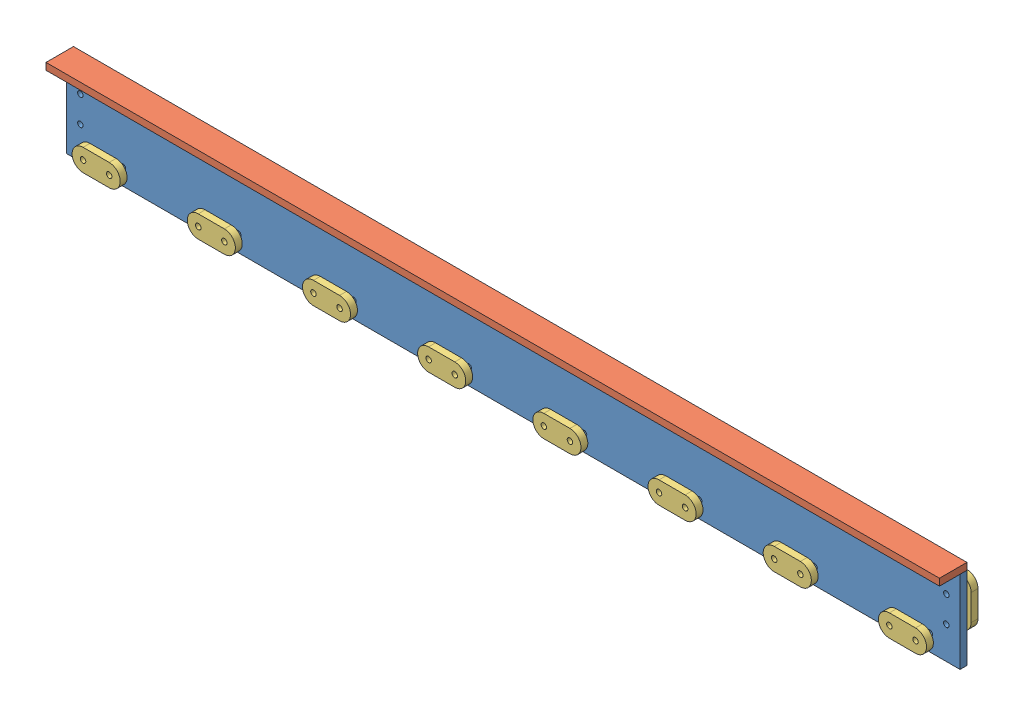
SolidWorks assembly fs-ua-right-mount-assembly.SLDASM, configuration Default (file format 9000). Lengths in mm.
Overall size (825.5 82.55 38.15).
12 component instances, 3 part files, 8 mates.
Components (placement in the parent):
- fs-ua-right-mount-vertical-component-1: fs-ua-right-mount-vertical-component.SLDPRT [Default] at origin size (825.5 76.2 6.35)
- fs-ua-right-mount-horizontal-component-1: fs-ua-right-mount-horizontal-component.SLDPRT [Default] at (412.75 76.2 12.7) size (825.5 6.35 25.4)
- fs-clamp-1: fs-clamp.SLDPRT [Default] at (27.94 15.24 12.7326) size (44.45 20.32 6.35)
- fs-clamp-11: fs-clamp.SLDPRT [Default] at (12.7 29.845 -12.7409) x (0 1 0) z (0 0 1) size (44.45 20.32 6.35)
- fs-clamp-12: fs-clamp.SLDPRT [Default] at (812.8 29.845 -6.3972) x (0 1 0) z (0 0 -1) size (44.45 20.32 6.35)
- fs-clamp-4: fs-clamp.SLDPRT [Default] at (134.366 15.24 12.7326) size (44.45 20.32 6.35)
- fs-clamp-5: fs-clamp.SLDPRT [Default] at (240.792 15.24 12.7326) size (44.45 20.32 6.35)
- fs-clamp-6: fs-clamp.SLDPRT [Default] at (347.218 15.24 12.7326) size (44.45 20.32 6.35)
- fs-clamp-7: fs-clamp.SLDPRT [Default] at (453.644 15.24 12.7326) size (44.45 20.32 6.35)
- fs-clamp-8: fs-clamp.SLDPRT [Default] at (560.07 15.24 12.7326) size (44.45 20.32 6.35)
- fs-clamp-9: fs-clamp.SLDPRT [Default] at (666.496 15.24 12.7326) size (44.45 20.32 6.35)
- fs-clamp-10: fs-clamp.SLDPRT [Default] at (772.922 15.24 12.7326) size (44.45 20.32 6.35)
Mates (geometry in assembly coordinates):
- Coincident1: coincident aligned: line of fs-ua-right-mount-vertical-component-1 through (825.5 825.5 76.2) axis (0 -1 0); line of fs-ua-right-mount-horizontal-component-1 through (825.5 825.5 76.2) axis (0 -1 0)
- Coincident2: coincident anti-aligned: line of fs-ua-right-mount-vertical-component-1 through (0 76.2 6.35) axis (0 0 -1); line of fs-ua-right-mount-horizontal-component-1 through (0 76.2 0) axis (0 0 1)
- Concentric1: concentric anti-aligned: cylinder of fs-ua-right-mount-vertical-component-1 through (27.94 15.24 -7.1842) axis (0 0 1) radius 2.54; cylinder of fs-clamp-1 through (27.94 15.24 19.0826) axis (0 0 -1) radius 2.54
- Concentric2: concentric anti-aligned: cylinder of fs-ua-right-mount-vertical-component-1 through (52.07 15.24 -7.1842) axis (0 0 1) radius 2.54; cylinder of fs-clamp-1 through (52.07 15.24 19.0826) axis (0 0 -1) radius 2.54
- Concentric3: concentric anti-aligned: cylinder of fs-ua-right-mount-vertical-component-1 through (12.7 29.845 -7.1842) axis (0 0 1) radius 2.54; cylinder of fs-clamp-11 through (12.7 29.845 -6.3909) axis (0 0 -1) radius 2.54
- Concentric4: concentric anti-aligned: cylinder of fs-ua-right-mount-vertical-component-1 through (12.7 53.975 -7.1842) axis (0 0 1) radius 2.54; cylinder of fs-clamp-11 through (12.7 53.975 -6.3909) axis (0 0 -1) radius 2.54
- Concentric5: concentric aligned: cylinder of fs-ua-right-mount-vertical-component-1 through (812.8 53.975 -7.1842) axis (0 0 1) radius 2.54; cylinder of fs-clamp-12 through (812.8 53.975 -12.7472) axis (0 0 1) radius 2.54
- Concentric6: concentric aligned: cylinder of fs-ua-right-mount-vertical-component-1 through (812.8 29.845 -7.1842) axis (0 0 1) radius 2.54; cylinder of fs-clamp-12 through (812.8 29.845 -12.7472) axis (0 0 1) radius 2.54
